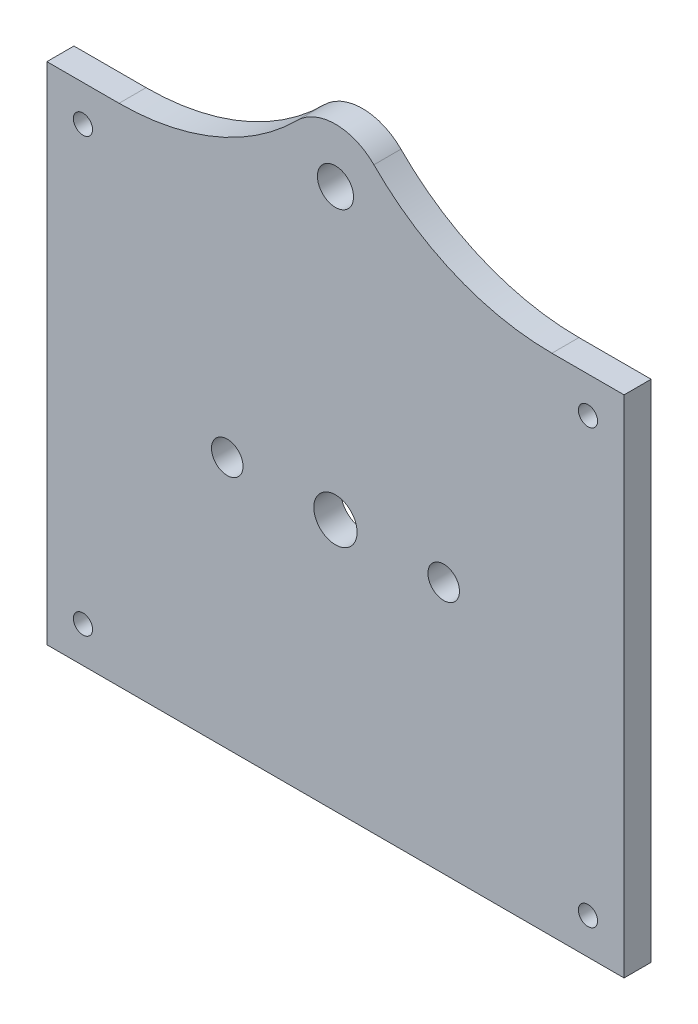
ISO-10303-21;
HEADER;
FILE_DESCRIPTION(('STEP AP214'),'2;1');
FILE_NAME('part.step','',(''),(''),'','','');
FILE_SCHEMA(('AUTOMOTIVE_DESIGN { 1 0 10303 214 1 1 1 1 }'));
ENDSEC;
DATA;
#1=APPLICATION_CONTEXT('core data for automotive mechanical design processes');
#2=APPLICATION_PROTOCOL_DEFINITION('international standard','automotive_design',2000,#1);
#3=PRODUCT_CONTEXT('',#1,'mechanical');
#4=PRODUCT('Part','Part','',(#3));
#5=PRODUCT_RELATED_PRODUCT_CATEGORY('part','',(#4));
#6=PRODUCT_DEFINITION_FORMATION('','',#4);
#7=PRODUCT_DEFINITION_CONTEXT('part definition',#1,'design');
#8=PRODUCT_DEFINITION('design','',#6,#7);
#9=PRODUCT_DEFINITION_SHAPE('','',#8);
#10=(LENGTH_UNIT() NAMED_UNIT(*) SI_UNIT(.MILLI.,.METRE.));
#11=(NAMED_UNIT(*) PLANE_ANGLE_UNIT() SI_UNIT($,.RADIAN.));
#12=(NAMED_UNIT(*) SI_UNIT($,.STERADIAN.) SOLID_ANGLE_UNIT());
#13=UNCERTAINTY_MEASURE_WITH_UNIT(LENGTH_MEASURE(1.E-05),#10,'distance_accuracy_value','');
#14=(GEOMETRIC_REPRESENTATION_CONTEXT(3) GLOBAL_UNCERTAINTY_ASSIGNED_CONTEXT((#13)) GLOBAL_UNIT_ASSIGNED_CONTEXT((#10,
#11,#12)) REPRESENTATION_CONTEXT('',''));
#15=CARTESIAN_POINT('',(0.,0.,0.));
#16=DIRECTION('',(0.,0.,1.));
#17=DIRECTION('',(1.,0.,0.));
#18=AXIS2_PLACEMENT_3D('',#15,#16,#17);
#19=CARTESIAN_POINT('',(-76.2,177.165,9.525));
#20=DIRECTION('',(0.,0.,1.));
#21=DIRECTION('',(1.,0.,0.));
#22=AXIS2_PLACEMENT_3D('',#19,#20,#21);
#23=PLANE('',#22);
#24=CARTESIAN_POINT('',(0.,0.,9.525));
#25=DIRECTION('',(0.,0.,1.));
#26=DIRECTION('',(1.,0.,0.));
#27=AXIS2_PLACEMENT_3D('',#24,#25,#26);
#28=CIRCLE('',#27,7.62);
#29=CARTESIAN_POINT('',(7.62,0.,9.525));
#30=VERTEX_POINT('',#29);
#31=EDGE_CURVE('E223',#30,#30,#28,.T.);
#32=ORIENTED_EDGE('',*,*,#31,.F.);
#33=EDGE_LOOP('',(#32));
#34=FACE_BOUND('',#33,.T.);
#35=CARTESIAN_POINT('',(0.,101.6,9.525));
#36=DIRECTION('',(0.,0.,1.));
#37=DIRECTION('',(1.,0.,0.));
#38=AXIS2_PLACEMENT_3D('',#35,#36,#37);
#39=CIRCLE('',#38,6.35);
#40=CARTESIAN_POINT('',(6.35,101.6,9.525));
#41=VERTEX_POINT('',#40);
#42=EDGE_CURVE('E219',#41,#41,#39,.T.);
#43=ORIENTED_EDGE('',*,*,#42,.F.);
#44=EDGE_LOOP('',(#43));
#45=FACE_BOUND('',#44,.T.);
#46=CARTESIAN_POINT('',(88.9,76.2,9.525));
#47=DIRECTION('',(0.,0.,1.));
#48=DIRECTION('',(1.,0.,0.));
#49=AXIS2_PLACEMENT_3D('',#46,#47,#48);
#50=CIRCLE('',#49,3.3782);
#51=CARTESIAN_POINT('',(92.2782,76.2,9.525));
#52=VERTEX_POINT('',#51);
#53=EDGE_CURVE('E213',#52,#52,#50,.T.);
#54=ORIENTED_EDGE('',*,*,#53,.F.);
#55=EDGE_LOOP('',(#54));
#56=FACE_BOUND('',#55,.T.);
#57=CARTESIAN_POINT('',(-88.9,-76.2,9.525));
#58=DIRECTION('',(0.,0.,1.));
#59=DIRECTION('',(1.,0.,0.));
#60=AXIS2_PLACEMENT_3D('',#57,#58,#59);
#61=CIRCLE('',#60,3.3782);
#62=CARTESIAN_POINT('',(-85.5218,-76.2,9.525));
#63=VERTEX_POINT('',#62);
#64=EDGE_CURVE('E207',#63,#63,#61,.T.);
#65=ORIENTED_EDGE('',*,*,#64,.F.);
#66=EDGE_LOOP('',(#65));
#67=FACE_BOUND('',#66,.T.);
#68=CARTESIAN_POINT('',(-88.9,76.2,9.525));
#69=DIRECTION('',(0.,0.,1.));
#70=DIRECTION('',(1.,0.,0.));
#71=AXIS2_PLACEMENT_3D('',#68,#69,#70);
#72=CIRCLE('',#71,3.3782);
#73=CARTESIAN_POINT('',(-85.5218,76.2,9.525));
#74=VERTEX_POINT('',#73);
#75=EDGE_CURVE('E201',#74,#74,#72,.T.);
#76=ORIENTED_EDGE('',*,*,#75,.F.);
#77=EDGE_LOOP('',(#76));
#78=FACE_BOUND('',#77,.T.);
#79=CARTESIAN_POINT('',(88.9,-76.2,9.525));
#80=DIRECTION('',(0.,0.,1.));
#81=DIRECTION('',(1.,0.,0.));
#82=AXIS2_PLACEMENT_3D('',#79,#80,#81);
#83=CIRCLE('',#82,3.3782);
#84=CARTESIAN_POINT('',(92.2782,-76.2,9.525));
#85=VERTEX_POINT('',#84);
#86=EDGE_CURVE('E195',#85,#85,#83,.T.);
#87=ORIENTED_EDGE('',*,*,#86,.F.);
#88=EDGE_LOOP('',(#87));
#89=FACE_BOUND('',#88,.T.);
#90=CARTESIAN_POINT('',(-38.1,0.,9.525));
#91=DIRECTION('',(0.,0.,1.));
#92=DIRECTION('',(1.,0.,0.));
#93=AXIS2_PLACEMENT_3D('',#90,#91,#92);
#94=CIRCLE('',#93,5.55625);
#95=CARTESIAN_POINT('',(-43.65625,0.,9.525));
#96=VERTEX_POINT('',#95);
#97=EDGE_CURVE('E136',#96,#96,#94,.T.);
#98=ORIENTED_EDGE('',*,*,#97,.F.);
#99=EDGE_LOOP('',(#98));
#100=FACE_BOUND('',#99,.T.);
#101=CARTESIAN_POINT('',(-76.2,177.165,9.525));
#102=DIRECTION('',(0.,0.,-1.));
#103=DIRECTION('',(1.,0.,0.));
#104=AXIS2_PLACEMENT_3D('',#101,#102,#103);
#105=CIRCLE('',#104,88.265);
#106=CARTESIAN_POINT('',(-13.5266272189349,115.013905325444,9.525));
#107=VERTEX_POINT('',#106);
#108=CARTESIAN_POINT('',(-76.2,88.9,9.525));
#109=VERTEX_POINT('',#108);
#110=EDGE_CURVE('E147',#107,#109,#105,.T.);
#111=ORIENTED_EDGE('',*,*,#110,.T.);
#112=DIRECTION('',(-1.,0.,0.));
#113=VECTOR('',#112,1.);
#114=CARTESIAN_POINT('',(-76.2,88.9,9.525));
#115=LINE('',#114,#113);
#116=CARTESIAN_POINT('',(-101.6,88.9,9.525));
#117=VERTEX_POINT('',#116);
#118=EDGE_CURVE('E95',#109,#117,#115,.T.);
#119=ORIENTED_EDGE('',*,*,#118,.T.);
#120=DIRECTION('',(0.,-1.,0.));
#121=VECTOR('',#120,1.);
#122=CARTESIAN_POINT('',(-101.6,-88.9,9.525));
#123=LINE('',#122,#121);
#124=CARTESIAN_POINT('',(-101.6,-88.9,9.525));
#125=VERTEX_POINT('',#124);
#126=EDGE_CURVE('E162',#117,#125,#123,.T.);
#127=ORIENTED_EDGE('',*,*,#126,.T.);
#128=DIRECTION('',(1.,0.,0.));
#129=VECTOR('',#128,1.);
#130=CARTESIAN_POINT('',(-101.6,-88.9,9.525));
#131=LINE('',#130,#129);
#132=CARTESIAN_POINT('',(101.6,-88.9,9.525));
#133=VERTEX_POINT('',#132);
#134=EDGE_CURVE('E175',#125,#133,#131,.T.);
#135=ORIENTED_EDGE('',*,*,#134,.T.);
#136=DIRECTION('',(0.,1.,0.));
#137=VECTOR('',#136,1.);
#138=CARTESIAN_POINT('',(101.6,-88.9,9.525));
#139=LINE('',#138,#137);
#140=CARTESIAN_POINT('',(101.6,88.9,9.525));
#141=VERTEX_POINT('',#140);
#142=EDGE_CURVE('E114',#133,#141,#139,.T.);
#143=ORIENTED_EDGE('',*,*,#142,.T.);
#144=DIRECTION('',(-1.,0.,0.));
#145=VECTOR('',#144,1.);
#146=CARTESIAN_POINT('',(101.6,88.9,9.525));
#147=LINE('',#146,#145);
#148=CARTESIAN_POINT('',(76.2,88.9,9.525));
#149=VERTEX_POINT('',#148);
#150=EDGE_CURVE('E108',#141,#149,#147,.T.);
#151=ORIENTED_EDGE('',*,*,#150,.T.);
#152=CARTESIAN_POINT('',(76.2,177.165,9.525));
#153=DIRECTION('',(0.,0.,-1.));
#154=DIRECTION('',(-1.,0.,0.));
#155=AXIS2_PLACEMENT_3D('',#152,#153,#154);
#156=CIRCLE('',#155,88.265);
#157=CARTESIAN_POINT('',(13.5266272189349,115.013905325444,9.525));
#158=VERTEX_POINT('',#157);
#159=EDGE_CURVE('E112',#149,#158,#156,.T.);
#160=ORIENTED_EDGE('',*,*,#159,.T.);
#161=CARTESIAN_POINT('',(0.,101.6,9.525));
#162=DIRECTION('',(0.,0.,1.));
#163=DIRECTION('',(1.,0.,0.));
#164=AXIS2_PLACEMENT_3D('',#161,#162,#163);
#165=CIRCLE('',#164,19.05);
#166=EDGE_CURVE('E52',#158,#107,#165,.T.);
#167=ORIENTED_EDGE('',*,*,#166,.T.);
#168=EDGE_LOOP('',(#111,#119,#127,#135,#143,#151,#160,#167));
#169=FACE_BOUND('',#168,.T.);
#170=CARTESIAN_POINT('',(38.1,0.,9.525));
#171=DIRECTION('',(0.,0.,1.));
#172=DIRECTION('',(-1.,0.,0.));
#173=AXIS2_PLACEMENT_3D('',#170,#171,#172);
#174=CIRCLE('',#173,5.55625);
#175=CARTESIAN_POINT('',(32.54375,0.,9.525));
#176=VERTEX_POINT('',#175);
#177=EDGE_CURVE('E184',#176,#176,#174,.T.);
#178=ORIENTED_EDGE('',*,*,#177,.F.);
#179=EDGE_LOOP('',(#178));
#180=FACE_BOUND('',#179,.T.);
#181=ADVANCED_FACE('F35',(#34,#45,#56,#67,#78,#89,#100,#169,#180),#23,.T.);
#182=CARTESIAN_POINT('',(-76.2,177.165,0.));
#183=DIRECTION('',(0.,0.,1.));
#184=DIRECTION('',(1.,0.,0.));
#185=AXIS2_PLACEMENT_3D('',#182,#183,#184);
#186=PLANE('',#185);
#187=CARTESIAN_POINT('',(0.,0.,0.));
#188=DIRECTION('',(0.,0.,1.));
#189=DIRECTION('',(1.,0.,0.));
#190=AXIS2_PLACEMENT_3D('',#187,#188,#189);
#191=CIRCLE('',#190,7.62);
#192=CARTESIAN_POINT('',(7.62,0.,0.));
#193=VERTEX_POINT('',#192);
#194=EDGE_CURVE('E222',#193,#193,#191,.T.);
#195=ORIENTED_EDGE('',*,*,#194,.T.);
#196=EDGE_LOOP('',(#195));
#197=FACE_BOUND('',#196,.T.);
#198=CARTESIAN_POINT('',(0.,101.6,0.));
#199=DIRECTION('',(0.,0.,1.));
#200=DIRECTION('',(1.,0.,0.));
#201=AXIS2_PLACEMENT_3D('',#198,#199,#200);
#202=CIRCLE('',#201,6.35);
#203=CARTESIAN_POINT('',(6.35,101.6,0.));
#204=VERTEX_POINT('',#203);
#205=EDGE_CURVE('E216',#204,#204,#202,.T.);
#206=ORIENTED_EDGE('',*,*,#205,.T.);
#207=EDGE_LOOP('',(#206));
#208=FACE_BOUND('',#207,.T.);
#209=CARTESIAN_POINT('',(88.9,76.2,0.));
#210=DIRECTION('',(0.,0.,1.));
#211=DIRECTION('',(1.,0.,0.));
#212=AXIS2_PLACEMENT_3D('',#209,#210,#211);
#213=CIRCLE('',#212,3.3782);
#214=CARTESIAN_POINT('',(92.2782,76.2,0.));
#215=VERTEX_POINT('',#214);
#216=EDGE_CURVE('E210',#215,#215,#213,.T.);
#217=ORIENTED_EDGE('',*,*,#216,.T.);
#218=EDGE_LOOP('',(#217));
#219=FACE_BOUND('',#218,.T.);
#220=CARTESIAN_POINT('',(-88.9,-76.2,0.));
#221=DIRECTION('',(0.,0.,1.));
#222=DIRECTION('',(1.,0.,0.));
#223=AXIS2_PLACEMENT_3D('',#220,#221,#222);
#224=CIRCLE('',#223,3.3782);
#225=CARTESIAN_POINT('',(-85.5218,-76.2,0.));
#226=VERTEX_POINT('',#225);
#227=EDGE_CURVE('E204',#226,#226,#224,.T.);
#228=ORIENTED_EDGE('',*,*,#227,.T.);
#229=EDGE_LOOP('',(#228));
#230=FACE_BOUND('',#229,.T.);
#231=CARTESIAN_POINT('',(-88.9,76.2,0.));
#232=DIRECTION('',(0.,0.,1.));
#233=DIRECTION('',(1.,0.,0.));
#234=AXIS2_PLACEMENT_3D('',#231,#232,#233);
#235=CIRCLE('',#234,3.3782);
#236=CARTESIAN_POINT('',(-85.5218,76.2,0.));
#237=VERTEX_POINT('',#236);
#238=EDGE_CURVE('E198',#237,#237,#235,.T.);
#239=ORIENTED_EDGE('',*,*,#238,.T.);
#240=EDGE_LOOP('',(#239));
#241=FACE_BOUND('',#240,.T.);
#242=CARTESIAN_POINT('',(88.9,-76.2,0.));
#243=DIRECTION('',(0.,0.,1.));
#244=DIRECTION('',(1.,0.,0.));
#245=AXIS2_PLACEMENT_3D('',#242,#243,#244);
#246=CIRCLE('',#245,3.3782);
#247=CARTESIAN_POINT('',(92.2782,-76.2,0.));
#248=VERTEX_POINT('',#247);
#249=EDGE_CURVE('E190',#248,#248,#246,.T.);
#250=ORIENTED_EDGE('',*,*,#249,.T.);
#251=EDGE_LOOP('',(#250));
#252=FACE_BOUND('',#251,.T.);
#253=CARTESIAN_POINT('',(-76.2,177.165,0.));
#254=DIRECTION('',(0.,0.,-1.));
#255=DIRECTION('',(1.,0.,0.));
#256=AXIS2_PLACEMENT_3D('',#253,#254,#255);
#257=CIRCLE('',#256,88.265);
#258=CARTESIAN_POINT('',(-13.5266272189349,115.013905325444,0.));
#259=VERTEX_POINT('',#258);
#260=CARTESIAN_POINT('',(-76.2,88.9,0.));
#261=VERTEX_POINT('',#260);
#262=EDGE_CURVE('E132',#259,#261,#257,.T.);
#263=ORIENTED_EDGE('',*,*,#262,.F.);
#264=CARTESIAN_POINT('',(0.,101.6,0.));
#265=DIRECTION('',(0.,0.,1.));
#266=DIRECTION('',(1.,0.,0.));
#267=AXIS2_PLACEMENT_3D('',#264,#265,#266);
#268=CIRCLE('',#267,19.05);
#269=CARTESIAN_POINT('',(13.5266272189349,115.013905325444,0.));
#270=VERTEX_POINT('',#269);
#271=EDGE_CURVE('E87',#270,#259,#268,.T.);
#272=ORIENTED_EDGE('',*,*,#271,.F.);
#273=CARTESIAN_POINT('',(76.2,177.165,0.));
#274=DIRECTION('',(0.,0.,-1.));
#275=DIRECTION('',(-1.,0.,0.));
#276=AXIS2_PLACEMENT_3D('',#273,#274,#275);
#277=CIRCLE('',#276,88.265);
#278=CARTESIAN_POINT('',(76.2,88.9,0.));
#279=VERTEX_POINT('',#278);
#280=EDGE_CURVE('E81',#279,#270,#277,.T.);
#281=ORIENTED_EDGE('',*,*,#280,.F.);
#282=DIRECTION('',(-1.,0.,0.));
#283=VECTOR('',#282,1.);
#284=CARTESIAN_POINT('',(101.6,88.9,0.));
#285=LINE('',#284,#283);
#286=CARTESIAN_POINT('',(101.6,88.9,0.));
#287=VERTEX_POINT('',#286);
#288=EDGE_CURVE('E122',#287,#279,#285,.T.);
#289=ORIENTED_EDGE('',*,*,#288,.F.);
#290=DIRECTION('',(0.,1.,0.));
#291=VECTOR('',#290,1.);
#292=CARTESIAN_POINT('',(101.6,-88.9,0.));
#293=LINE('',#292,#291);
#294=CARTESIAN_POINT('',(101.6,-88.9,0.));
#295=VERTEX_POINT('',#294);
#296=EDGE_CURVE('E142',#295,#287,#293,.T.);
#297=ORIENTED_EDGE('',*,*,#296,.F.);
#298=DIRECTION('',(1.,0.,0.));
#299=VECTOR('',#298,1.);
#300=CARTESIAN_POINT('',(-101.6,-88.9,0.));
#301=LINE('',#300,#299);
#302=CARTESIAN_POINT('',(-101.6,-88.9,0.));
#303=VERTEX_POINT('',#302);
#304=EDGE_CURVE('E140',#303,#295,#301,.T.);
#305=ORIENTED_EDGE('',*,*,#304,.F.);
#306=DIRECTION('',(0.,-1.,0.));
#307=VECTOR('',#306,1.);
#308=CARTESIAN_POINT('',(-101.6,-88.9,0.));
#309=LINE('',#308,#307);
#310=CARTESIAN_POINT('',(-101.6,88.9,0.));
#311=VERTEX_POINT('',#310);
#312=EDGE_CURVE('E138',#311,#303,#309,.T.);
#313=ORIENTED_EDGE('',*,*,#312,.F.);
#314=DIRECTION('',(-1.,0.,0.));
#315=VECTOR('',#314,1.);
#316=CARTESIAN_POINT('',(-76.2,88.9,0.));
#317=LINE('',#316,#315);
#318=EDGE_CURVE('E135',#261,#311,#317,.T.);
#319=ORIENTED_EDGE('',*,*,#318,.F.);
#320=EDGE_LOOP('',(#263,#272,#281,#289,#297,#305,#313,#319));
#321=FACE_BOUND('',#320,.T.);
#322=CARTESIAN_POINT('',(-38.1,0.,0.));
#323=DIRECTION('',(0.,0.,1.));
#324=DIRECTION('',(1.,0.,0.));
#325=AXIS2_PLACEMENT_3D('',#322,#323,#324);
#326=CIRCLE('',#325,5.55625);
#327=CARTESIAN_POINT('',(-43.65625,0.,0.));
#328=VERTEX_POINT('',#327);
#329=EDGE_CURVE('E181',#328,#328,#326,.T.);
#330=ORIENTED_EDGE('',*,*,#329,.T.);
#331=EDGE_LOOP('',(#330));
#332=FACE_BOUND('',#331,.T.);
#333=CARTESIAN_POINT('',(38.1,0.,0.));
#334=DIRECTION('',(0.,0.,1.));
#335=DIRECTION('',(-1.,0.,0.));
#336=AXIS2_PLACEMENT_3D('',#333,#334,#335);
#337=CIRCLE('',#336,5.55625);
#338=CARTESIAN_POINT('',(32.54375,0.,0.));
#339=VERTEX_POINT('',#338);
#340=EDGE_CURVE('E187',#339,#339,#337,.T.);
#341=ORIENTED_EDGE('',*,*,#340,.T.);
#342=EDGE_LOOP('',(#341));
#343=FACE_BOUND('',#342,.T.);
#344=ADVANCED_FACE('F166',(#197,#208,#219,#230,#241,#252,#321,#332,#343),#186,.F.);
#345=CARTESIAN_POINT('',(-76.2,177.165,9.525));
#346=DIRECTION('',(0.,0.,-1.));
#347=DIRECTION('',(-1.,0.,0.));
#348=AXIS2_PLACEMENT_3D('',#345,#346,#347);
#349=CYLINDRICAL_SURFACE('',#348,88.265);
#350=ORIENTED_EDGE('',*,*,#262,.T.);
#351=DIRECTION('',(0.,0.,-1.));
#352=VECTOR('',#351,1.);
#353=CARTESIAN_POINT('',(-76.2,88.9,9.525));
#354=LINE('',#353,#352);
#355=EDGE_CURVE('E11',#109,#261,#354,.T.);
#356=ORIENTED_EDGE('',*,*,#355,.F.);
#357=ORIENTED_EDGE('',*,*,#110,.F.);
#358=DIRECTION('',(0.,0.,-1.));
#359=VECTOR('',#358,1.);
#360=CARTESIAN_POINT('',(-13.5266272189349,115.013905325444,9.525));
#361=LINE('',#360,#359);
#362=EDGE_CURVE('E128',#107,#259,#361,.T.);
#363=ORIENTED_EDGE('',*,*,#362,.T.);
#364=EDGE_LOOP('',(#350,#356,#357,#363));
#365=FACE_BOUND('',#364,.T.);
#366=ADVANCED_FACE('F37',(#365),#349,.F.);
#367=CARTESIAN_POINT('',(-76.2,88.9,9.525));
#368=DIRECTION('',(0.,-1.,0.));
#369=DIRECTION('',(0.,0.,-1.));
#370=AXIS2_PLACEMENT_3D('',#367,#368,#369);
#371=PLANE('',#370);
#372=ORIENTED_EDGE('',*,*,#318,.T.);
#373=DIRECTION('',(0.,0.,-1.));
#374=VECTOR('',#373,1.);
#375=CARTESIAN_POINT('',(-101.6,88.9,9.525));
#376=LINE('',#375,#374);
#377=EDGE_CURVE('E44',#117,#311,#376,.T.);
#378=ORIENTED_EDGE('',*,*,#377,.F.);
#379=ORIENTED_EDGE('',*,*,#118,.F.);
#380=ORIENTED_EDGE('',*,*,#355,.T.);
#381=EDGE_LOOP('',(#372,#378,#379,#380));
#382=FACE_BOUND('',#381,.T.);
#383=ADVANCED_FACE('F288',(#382),#371,.F.);
#384=CARTESIAN_POINT('',(-101.6,-88.9,9.525));
#385=DIRECTION('',(1.,0.,0.));
#386=DIRECTION('',(0.,0.,-1.));
#387=AXIS2_PLACEMENT_3D('',#384,#385,#386);
#388=PLANE('',#387);
#389=ORIENTED_EDGE('',*,*,#312,.T.);
#390=DIRECTION('',(0.,0.,-1.));
#391=VECTOR('',#390,1.);
#392=CARTESIAN_POINT('',(-101.6,-88.9,9.525));
#393=LINE('',#392,#391);
#394=EDGE_CURVE('E154',#125,#303,#393,.T.);
#395=ORIENTED_EDGE('',*,*,#394,.F.);
#396=ORIENTED_EDGE('',*,*,#126,.F.);
#397=ORIENTED_EDGE('',*,*,#377,.T.);
#398=EDGE_LOOP('',(#389,#395,#396,#397));
#399=FACE_BOUND('',#398,.T.);
#400=ADVANCED_FACE('F160',(#399),#388,.F.);
#401=CARTESIAN_POINT('',(-101.6,-88.9,9.525));
#402=DIRECTION('',(0.,1.,0.));
#403=DIRECTION('',(-1.,0.,0.));
#404=AXIS2_PLACEMENT_3D('',#401,#402,#403);
#405=PLANE('',#404);
#406=ORIENTED_EDGE('',*,*,#304,.T.);
#407=DIRECTION('',(0.,0.,-1.));
#408=VECTOR('',#407,1.);
#409=CARTESIAN_POINT('',(101.6,-88.9,9.525));
#410=LINE('',#409,#408);
#411=EDGE_CURVE('E151',#133,#295,#410,.T.);
#412=ORIENTED_EDGE('',*,*,#411,.F.);
#413=ORIENTED_EDGE('',*,*,#134,.F.);
#414=ORIENTED_EDGE('',*,*,#394,.T.);
#415=EDGE_LOOP('',(#406,#412,#413,#414));
#416=FACE_BOUND('',#415,.T.);
#417=ADVANCED_FACE('F171',(#416),#405,.F.);
#418=CARTESIAN_POINT('',(101.6,-88.9,9.525));
#419=DIRECTION('',(-1.,0.,0.));
#420=DIRECTION('',(0.,0.,1.));
#421=AXIS2_PLACEMENT_3D('',#418,#419,#420);
#422=PLANE('',#421);
#423=ORIENTED_EDGE('',*,*,#296,.T.);
#424=DIRECTION('',(0.,0.,-1.));
#425=VECTOR('',#424,1.);
#426=CARTESIAN_POINT('',(101.6,88.9,9.525));
#427=LINE('',#426,#425);
#428=EDGE_CURVE('E123',#141,#287,#427,.T.);
#429=ORIENTED_EDGE('',*,*,#428,.F.);
#430=ORIENTED_EDGE('',*,*,#142,.F.);
#431=ORIENTED_EDGE('',*,*,#411,.T.);
#432=EDGE_LOOP('',(#423,#429,#430,#431));
#433=FACE_BOUND('',#432,.T.);
#434=ADVANCED_FACE('F174',(#433),#422,.F.);
#435=CARTESIAN_POINT('',(101.6,88.9,9.525));
#436=DIRECTION('',(0.,-1.,0.));
#437=DIRECTION('',(1.,0.,0.));
#438=AXIS2_PLACEMENT_3D('',#435,#436,#437);
#439=PLANE('',#438);
#440=ORIENTED_EDGE('',*,*,#288,.T.);
#441=DIRECTION('',(0.,0.,-1.));
#442=VECTOR('',#441,1.);
#443=CARTESIAN_POINT('',(76.2,88.9,9.525));
#444=LINE('',#443,#442);
#445=EDGE_CURVE('E119',#149,#279,#444,.T.);
#446=ORIENTED_EDGE('',*,*,#445,.F.);
#447=ORIENTED_EDGE('',*,*,#150,.F.);
#448=ORIENTED_EDGE('',*,*,#428,.T.);
#449=EDGE_LOOP('',(#440,#446,#447,#448));
#450=FACE_BOUND('',#449,.T.);
#451=ADVANCED_FACE('F120',(#450),#439,.F.);
#452=CARTESIAN_POINT('',(76.2,177.165,9.525));
#453=DIRECTION('',(0.,0.,-1.));
#454=DIRECTION('',(-1.,0.,0.));
#455=AXIS2_PLACEMENT_3D('',#452,#453,#454);
#456=CYLINDRICAL_SURFACE('',#455,88.265);
#457=ORIENTED_EDGE('',*,*,#280,.T.);
#458=DIRECTION('',(0.,0.,-1.));
#459=VECTOR('',#458,1.);
#460=CARTESIAN_POINT('',(13.5266272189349,115.013905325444,9.525));
#461=LINE('',#460,#459);
#462=EDGE_CURVE('E124',#158,#270,#461,.T.);
#463=ORIENTED_EDGE('',*,*,#462,.F.);
#464=ORIENTED_EDGE('',*,*,#159,.F.);
#465=ORIENTED_EDGE('',*,*,#445,.T.);
#466=EDGE_LOOP('',(#457,#463,#464,#465));
#467=FACE_BOUND('',#466,.T.);
#468=ADVANCED_FACE('F126',(#467),#456,.F.);
#469=CARTESIAN_POINT('',(0.,101.6,9.525));
#470=DIRECTION('',(0.,0.,-1.));
#471=DIRECTION('',(-1.,0.,0.));
#472=AXIS2_PLACEMENT_3D('',#469,#470,#471);
#473=CYLINDRICAL_SURFACE('',#472,19.05);
#474=ORIENTED_EDGE('',*,*,#271,.T.);
#475=ORIENTED_EDGE('',*,*,#362,.F.);
#476=ORIENTED_EDGE('',*,*,#166,.F.);
#477=ORIENTED_EDGE('',*,*,#462,.T.);
#478=EDGE_LOOP('',(#474,#475,#476,#477));
#479=FACE_BOUND('',#478,.T.);
#480=ADVANCED_FACE('F257',(#479),#473,.T.);
#481=CARTESIAN_POINT('',(-38.1,0.,9.525));
#482=DIRECTION('',(0.,0.,-1.));
#483=DIRECTION('',(-1.,0.,0.));
#484=AXIS2_PLACEMENT_3D('',#481,#482,#483);
#485=CYLINDRICAL_SURFACE('',#484,5.55625);
#486=CARTESIAN_POINT('',(-43.65625,0.,9.525));
#487=CARTESIAN_POINT('',(-43.65625,0.,9.42578125));
#488=CARTESIAN_POINT('',(-43.65625,0.,9.3265625));
#489=CARTESIAN_POINT('',(-43.65625,0.,9.128125));
#490=CARTESIAN_POINT('',(-43.65625,0.,9.02890625));
#491=CARTESIAN_POINT('',(-43.65625,0.,8.83046875));
#492=CARTESIAN_POINT('',(-43.65625,0.,8.73125));
#493=CARTESIAN_POINT('',(-43.65625,0.,8.5328125));
#494=CARTESIAN_POINT('',(-43.65625,0.,8.43359375));
#495=CARTESIAN_POINT('',(-43.65625,0.,8.23515625));
#496=CARTESIAN_POINT('',(-43.65625,0.,8.1359375));
#497=CARTESIAN_POINT('',(-43.65625,0.,7.9375));
#498=CARTESIAN_POINT('',(-43.65625,0.,7.83828125));
#499=CARTESIAN_POINT('',(-43.65625,0.,7.63984375));
#500=CARTESIAN_POINT('',(-43.65625,0.,7.540625));
#501=CARTESIAN_POINT('',(-43.65625,0.,7.3421875));
#502=CARTESIAN_POINT('',(-43.65625,0.,7.24296875));
#503=CARTESIAN_POINT('',(-43.65625,0.,7.04453125));
#504=CARTESIAN_POINT('',(-43.65625,0.,6.9453125));
#505=CARTESIAN_POINT('',(-43.65625,0.,6.746875));
#506=CARTESIAN_POINT('',(-43.65625,0.,6.64765625));
#507=CARTESIAN_POINT('',(-43.65625,0.,6.44921875));
#508=CARTESIAN_POINT('',(-43.65625,0.,6.35));
#509=CARTESIAN_POINT('',(-43.65625,0.,6.1515625));
#510=CARTESIAN_POINT('',(-43.65625,0.,6.05234375));
#511=CARTESIAN_POINT('',(-43.65625,0.,5.85390625));
#512=CARTESIAN_POINT('',(-43.65625,0.,5.7546875));
#513=CARTESIAN_POINT('',(-43.65625,0.,5.55625));
#514=CARTESIAN_POINT('',(-43.65625,0.,5.45703125));
#515=CARTESIAN_POINT('',(-43.65625,0.,5.25859375));
#516=CARTESIAN_POINT('',(-43.65625,0.,5.159375));
#517=CARTESIAN_POINT('',(-43.65625,0.,4.9609375));
#518=CARTESIAN_POINT('',(-43.65625,0.,4.86171875));
#519=CARTESIAN_POINT('',(-43.65625,0.,4.66328125));
#520=CARTESIAN_POINT('',(-43.65625,0.,4.5640625));
#521=CARTESIAN_POINT('',(-43.65625,0.,4.365625));
#522=CARTESIAN_POINT('',(-43.65625,0.,4.26640625));
#523=CARTESIAN_POINT('',(-43.65625,0.,4.06796875));
#524=CARTESIAN_POINT('',(-43.65625,0.,3.96875));
#525=CARTESIAN_POINT('',(-43.65625,0.,3.7703125));
#526=CARTESIAN_POINT('',(-43.65625,0.,3.67109375));
#527=CARTESIAN_POINT('',(-43.65625,0.,3.47265625));
#528=CARTESIAN_POINT('',(-43.65625,0.,3.3734375));
#529=CARTESIAN_POINT('',(-43.65625,0.,3.175));
#530=CARTESIAN_POINT('',(-43.65625,0.,3.07578125));
#531=CARTESIAN_POINT('',(-43.65625,0.,2.87734375));
#532=CARTESIAN_POINT('',(-43.65625,0.,2.778125));
#533=CARTESIAN_POINT('',(-43.65625,0.,2.5796875));
#534=CARTESIAN_POINT('',(-43.65625,0.,2.48046875));
#535=CARTESIAN_POINT('',(-43.65625,0.,2.28203125));
#536=CARTESIAN_POINT('',(-43.65625,0.,2.1828125));
#537=CARTESIAN_POINT('',(-43.65625,0.,1.984375));
#538=CARTESIAN_POINT('',(-43.65625,0.,1.88515625));
#539=CARTESIAN_POINT('',(-43.65625,0.,1.68671875));
#540=CARTESIAN_POINT('',(-43.65625,0.,1.5875));
#541=CARTESIAN_POINT('',(-43.65625,0.,1.3890625));
#542=CARTESIAN_POINT('',(-43.65625,0.,1.28984375));
#543=CARTESIAN_POINT('',(-43.65625,0.,1.09140625));
#544=CARTESIAN_POINT('',(-43.65625,0.,0.992187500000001));
#545=CARTESIAN_POINT('',(-43.65625,0.,0.793750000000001));
#546=CARTESIAN_POINT('',(-43.65625,0.,0.69453125));
#547=CARTESIAN_POINT('',(-43.65625,0.,0.49609375));
#548=CARTESIAN_POINT('',(-43.65625,0.,0.396875));
#549=CARTESIAN_POINT('',(-43.65625,0.,0.1984375));
#550=CARTESIAN_POINT('',(-43.65625,0.,0.0992187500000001));
#551=CARTESIAN_POINT('',(-43.65625,0.,0.));
#552=B_SPLINE_CURVE_WITH_KNOTS('',3,(#486,#487,#488,#489,#490,#491,#492,#493,#494,#495,#496,
#497,#498,#499,#500,#501,#502,#503,#504,#505,#506,#507,#508,#509,#510,#511,#512,#513,#514,#515,
#516,#517,#518,#519,#520,#521,#522,#523,#524,#525,#526,#527,#528,#529,#530,#531,#532,#533,#534,
#535,#536,#537,#538,#539,#540,#541,#542,#543,#544,#545,#546,#547,#548,#549,#550,#551),
.UNSPECIFIED.,.F.,.F.,(4,2,2,2,2,2,2,2,2,2,2,2,2,2,2,2,2,2,2,2,2,2,2,2,2,2,2,2,2,2,2,2,4),(0.,
0.29765625,0.5953125,0.892968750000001,1.190625,1.48828125,1.7859375,2.08359375,2.38125,
2.67890625,2.9765625,3.27421875,3.571875,3.86953125,4.1671875,4.46484375,4.7625,5.06015625,
5.3578125,5.65546875,5.953125,6.25078125,6.5484375,6.84609375,7.14375,7.44140625,7.7390625,
8.03671875,8.334375,8.63203125,8.9296875,9.22734375,9.525),.UNSPECIFIED.);
#553=EDGE_CURVE('BSEAM253',#96,#328,#552,.T.);
#554=ORIENTED_EDGE('',*,*,#97,.T.);
#555=ORIENTED_EDGE('',*,*,#329,.F.);
#556=ORIENTED_EDGE('',*,*,#553,.T.);
#557=ORIENTED_EDGE('',*,*,#553,.F.);
#558=EDGE_LOOP('',(#554,#556,#555,#557));
#559=FACE_BOUND('',#558,.T.);
#560=ADVANCED_FACE('F253',(#559),#485,.F.);
#561=CARTESIAN_POINT('',(38.1,0.,9.525));
#562=DIRECTION('',(0.,0.,-1.));
#563=DIRECTION('',(-1.,0.,0.));
#564=AXIS2_PLACEMENT_3D('',#561,#562,#563);
#565=CYLINDRICAL_SURFACE('',#564,5.55625);
#566=CARTESIAN_POINT('',(32.54375,0.,9.525));
#567=CARTESIAN_POINT('',(32.54375,0.,9.42578125));
#568=CARTESIAN_POINT('',(32.54375,0.,9.3265625));
#569=CARTESIAN_POINT('',(32.54375,0.,9.128125));
#570=CARTESIAN_POINT('',(32.54375,0.,9.02890625));
#571=CARTESIAN_POINT('',(32.54375,0.,8.83046875));
#572=CARTESIAN_POINT('',(32.54375,0.,8.73125));
#573=CARTESIAN_POINT('',(32.54375,0.,8.5328125));
#574=CARTESIAN_POINT('',(32.54375,0.,8.43359375));
#575=CARTESIAN_POINT('',(32.54375,0.,8.23515625));
#576=CARTESIAN_POINT('',(32.54375,0.,8.1359375));
#577=CARTESIAN_POINT('',(32.54375,0.,7.9375));
#578=CARTESIAN_POINT('',(32.54375,0.,7.83828125));
#579=CARTESIAN_POINT('',(32.54375,0.,7.63984375));
#580=CARTESIAN_POINT('',(32.54375,0.,7.540625));
#581=CARTESIAN_POINT('',(32.54375,0.,7.3421875));
#582=CARTESIAN_POINT('',(32.54375,0.,7.24296875));
#583=CARTESIAN_POINT('',(32.54375,0.,7.04453125));
#584=CARTESIAN_POINT('',(32.54375,0.,6.9453125));
#585=CARTESIAN_POINT('',(32.54375,0.,6.746875));
#586=CARTESIAN_POINT('',(32.54375,0.,6.64765625));
#587=CARTESIAN_POINT('',(32.54375,0.,6.44921875));
#588=CARTESIAN_POINT('',(32.54375,0.,6.35));
#589=CARTESIAN_POINT('',(32.54375,0.,6.1515625));
#590=CARTESIAN_POINT('',(32.54375,0.,6.05234375));
#591=CARTESIAN_POINT('',(32.54375,0.,5.85390625));
#592=CARTESIAN_POINT('',(32.54375,0.,5.7546875));
#593=CARTESIAN_POINT('',(32.54375,0.,5.55625));
#594=CARTESIAN_POINT('',(32.54375,0.,5.45703125));
#595=CARTESIAN_POINT('',(32.54375,0.,5.25859375));
#596=CARTESIAN_POINT('',(32.54375,0.,5.159375));
#597=CARTESIAN_POINT('',(32.54375,0.,4.9609375));
#598=CARTESIAN_POINT('',(32.54375,0.,4.86171875));
#599=CARTESIAN_POINT('',(32.54375,0.,4.66328125));
#600=CARTESIAN_POINT('',(32.54375,0.,4.5640625));
#601=CARTESIAN_POINT('',(32.54375,0.,4.365625));
#602=CARTESIAN_POINT('',(32.54375,0.,4.26640625));
#603=CARTESIAN_POINT('',(32.54375,0.,4.06796875));
#604=CARTESIAN_POINT('',(32.54375,0.,3.96875));
#605=CARTESIAN_POINT('',(32.54375,0.,3.7703125));
#606=CARTESIAN_POINT('',(32.54375,0.,3.67109375));
#607=CARTESIAN_POINT('',(32.54375,0.,3.47265625));
#608=CARTESIAN_POINT('',(32.54375,0.,3.3734375));
#609=CARTESIAN_POINT('',(32.54375,0.,3.175));
#610=CARTESIAN_POINT('',(32.54375,0.,3.07578125));
#611=CARTESIAN_POINT('',(32.54375,0.,2.87734375));
#612=CARTESIAN_POINT('',(32.54375,0.,2.778125));
#613=CARTESIAN_POINT('',(32.54375,0.,2.5796875));
#614=CARTESIAN_POINT('',(32.54375,0.,2.48046875));
#615=CARTESIAN_POINT('',(32.54375,0.,2.28203125));
#616=CARTESIAN_POINT('',(32.54375,0.,2.1828125));
#617=CARTESIAN_POINT('',(32.54375,0.,1.984375));
#618=CARTESIAN_POINT('',(32.54375,0.,1.88515625));
#619=CARTESIAN_POINT('',(32.54375,0.,1.68671875));
#620=CARTESIAN_POINT('',(32.54375,0.,1.5875));
#621=CARTESIAN_POINT('',(32.54375,0.,1.3890625));
#622=CARTESIAN_POINT('',(32.54375,0.,1.28984375));
#623=CARTESIAN_POINT('',(32.54375,0.,1.09140625));
#624=CARTESIAN_POINT('',(32.54375,0.,0.992187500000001));
#625=CARTESIAN_POINT('',(32.54375,0.,0.793750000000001));
#626=CARTESIAN_POINT('',(32.54375,0.,0.69453125));
#627=CARTESIAN_POINT('',(32.54375,0.,0.49609375));
#628=CARTESIAN_POINT('',(32.54375,0.,0.396875));
#629=CARTESIAN_POINT('',(32.54375,0.,0.1984375));
#630=CARTESIAN_POINT('',(32.54375,0.,0.0992187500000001));
#631=CARTESIAN_POINT('',(32.54375,0.,0.));
#632=B_SPLINE_CURVE_WITH_KNOTS('',3,(#566,#567,#568,#569,#570,#571,#572,#573,#574,#575,#576,
#577,#578,#579,#580,#581,#582,#583,#584,#585,#586,#587,#588,#589,#590,#591,#592,#593,#594,#595,
#596,#597,#598,#599,#600,#601,#602,#603,#604,#605,#606,#607,#608,#609,#610,#611,#612,#613,#614,
#615,#616,#617,#618,#619,#620,#621,#622,#623,#624,#625,#626,#627,#628,#629,#630,#631),
.UNSPECIFIED.,.F.,.F.,(4,2,2,2,2,2,2,2,2,2,2,2,2,2,2,2,2,2,2,2,2,2,2,2,2,2,2,2,2,2,2,2,4),(0.,
0.29765625,0.5953125,0.892968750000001,1.190625,1.48828125,1.7859375,2.08359375,2.38125,
2.67890625,2.9765625,3.27421875,3.571875,3.86953125,4.1671875,4.46484375,4.7625,5.06015625,
5.3578125,5.65546875,5.953125,6.25078125,6.5484375,6.84609375,7.14375,7.44140625,7.7390625,
8.03671875,8.334375,8.63203125,8.9296875,9.22734375,9.525),.UNSPECIFIED.);
#633=EDGE_CURVE('BSEAM256',#176,#339,#632,.T.);
#634=ORIENTED_EDGE('',*,*,#177,.T.);
#635=ORIENTED_EDGE('',*,*,#340,.F.);
#636=ORIENTED_EDGE('',*,*,#633,.T.);
#637=ORIENTED_EDGE('',*,*,#633,.F.);
#638=EDGE_LOOP('',(#634,#636,#635,#637));
#639=FACE_BOUND('',#638,.T.);
#640=ADVANCED_FACE('F256',(#639),#565,.F.);
#641=CARTESIAN_POINT('',(88.9,-76.2,9.525));
#642=DIRECTION('',(0.,0.,1.));
#643=DIRECTION('',(1.,0.,0.));
#644=AXIS2_PLACEMENT_3D('',#641,#642,#643);
#645=CYLINDRICAL_SURFACE('',#644,3.3782);
#646=ORIENTED_EDGE('',*,*,#249,.F.);
#647=EDGE_LOOP('',(#646));
#648=FACE_BOUND('',#647,.T.);
#649=ORIENTED_EDGE('',*,*,#86,.T.);
#650=EDGE_LOOP('',(#649));
#651=FACE_BOUND('',#650,.T.);
#652=ADVANCED_FACE('F266',(#648,#651),#645,.F.);
#653=CARTESIAN_POINT('',(-88.9,76.2,9.525));
#654=DIRECTION('',(0.,0.,1.));
#655=DIRECTION('',(1.,0.,0.));
#656=AXIS2_PLACEMENT_3D('',#653,#654,#655);
#657=CYLINDRICAL_SURFACE('',#656,3.3782);
#658=ORIENTED_EDGE('',*,*,#238,.F.);
#659=EDGE_LOOP('',(#658));
#660=FACE_BOUND('',#659,.T.);
#661=ORIENTED_EDGE('',*,*,#75,.T.);
#662=EDGE_LOOP('',(#661));
#663=FACE_BOUND('',#662,.T.);
#664=ADVANCED_FACE('F272',(#660,#663),#657,.F.);
#665=CARTESIAN_POINT('',(-88.9,-76.2,9.525));
#666=DIRECTION('',(0.,0.,1.));
#667=DIRECTION('',(1.,0.,0.));
#668=AXIS2_PLACEMENT_3D('',#665,#666,#667);
#669=CYLINDRICAL_SURFACE('',#668,3.3782);
#670=ORIENTED_EDGE('',*,*,#227,.F.);
#671=EDGE_LOOP('',(#670));
#672=FACE_BOUND('',#671,.T.);
#673=ORIENTED_EDGE('',*,*,#64,.T.);
#674=EDGE_LOOP('',(#673));
#675=FACE_BOUND('',#674,.T.);
#676=ADVANCED_FACE('F327',(#672,#675),#669,.F.);
#677=CARTESIAN_POINT('',(88.9,76.2,9.525));
#678=DIRECTION('',(0.,0.,1.));
#679=DIRECTION('',(1.,0.,0.));
#680=AXIS2_PLACEMENT_3D('',#677,#678,#679);
#681=CYLINDRICAL_SURFACE('',#680,3.3782);
#682=ORIENTED_EDGE('',*,*,#216,.F.);
#683=EDGE_LOOP('',(#682));
#684=FACE_BOUND('',#683,.T.);
#685=ORIENTED_EDGE('',*,*,#53,.T.);
#686=EDGE_LOOP('',(#685));
#687=FACE_BOUND('',#686,.T.);
#688=ADVANCED_FACE('F316',(#684,#687),#681,.F.);
#689=CARTESIAN_POINT('',(0.,101.6,9.525));
#690=DIRECTION('',(0.,0.,1.));
#691=DIRECTION('',(1.,0.,0.));
#692=AXIS2_PLACEMENT_3D('',#689,#690,#691);
#693=CYLINDRICAL_SURFACE('',#692,6.35);
#694=ORIENTED_EDGE('',*,*,#205,.F.);
#695=EDGE_LOOP('',(#694));
#696=FACE_BOUND('',#695,.T.);
#697=ORIENTED_EDGE('',*,*,#42,.T.);
#698=EDGE_LOOP('',(#697));
#699=FACE_BOUND('',#698,.T.);
#700=ADVANCED_FACE('F234',(#696,#699),#693,.F.);
#701=CARTESIAN_POINT('',(0.,0.,0.));
#702=DIRECTION('',(0.,0.,1.));
#703=DIRECTION('',(1.,0.,0.));
#704=AXIS2_PLACEMENT_3D('',#701,#702,#703);
#705=CYLINDRICAL_SURFACE('',#704,7.62);
#706=CARTESIAN_POINT('',(7.62,0.,0.));
#707=CARTESIAN_POINT('',(7.62,0.,0.0992187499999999));
#708=CARTESIAN_POINT('',(7.62,0.,0.1984375));
#709=CARTESIAN_POINT('',(7.62,0.,0.396875));
#710=CARTESIAN_POINT('',(7.62,0.,0.49609375));
#711=CARTESIAN_POINT('',(7.62,0.,0.69453125));
#712=CARTESIAN_POINT('',(7.62,0.,0.79375));
#713=CARTESIAN_POINT('',(7.62,0.,0.9921875));
#714=CARTESIAN_POINT('',(7.62,0.,1.09140625));
#715=CARTESIAN_POINT('',(7.62,0.,1.28984375));
#716=CARTESIAN_POINT('',(7.62,0.,1.3890625));
#717=CARTESIAN_POINT('',(7.62,0.,1.5875));
#718=CARTESIAN_POINT('',(7.62,0.,1.68671875));
#719=CARTESIAN_POINT('',(7.62,0.,1.88515625));
#720=CARTESIAN_POINT('',(7.62,0.,1.984375));
#721=CARTESIAN_POINT('',(7.62,0.,2.1828125));
#722=CARTESIAN_POINT('',(7.62,0.,2.28203125));
#723=CARTESIAN_POINT('',(7.62,0.,2.48046875));
#724=CARTESIAN_POINT('',(7.62,0.,2.5796875));
#725=CARTESIAN_POINT('',(7.62,0.,2.778125));
#726=CARTESIAN_POINT('',(7.62,0.,2.87734375));
#727=CARTESIAN_POINT('',(7.62,0.,3.07578125));
#728=CARTESIAN_POINT('',(7.62,0.,3.175));
#729=CARTESIAN_POINT('',(7.62,0.,3.3734375));
#730=CARTESIAN_POINT('',(7.62,0.,3.47265625));
#731=CARTESIAN_POINT('',(7.62,0.,3.67109375));
#732=CARTESIAN_POINT('',(7.62,0.,3.7703125));
#733=CARTESIAN_POINT('',(7.62,0.,3.96875));
#734=CARTESIAN_POINT('',(7.62,0.,4.06796875));
#735=CARTESIAN_POINT('',(7.62,0.,4.26640625));
#736=CARTESIAN_POINT('',(7.62,0.,4.365625));
#737=CARTESIAN_POINT('',(7.62,0.,4.5640625));
#738=CARTESIAN_POINT('',(7.62,0.,4.66328125));
#739=CARTESIAN_POINT('',(7.62,0.,4.86171875));
#740=CARTESIAN_POINT('',(7.62,0.,4.9609375));
#741=CARTESIAN_POINT('',(7.62,0.,5.159375));
#742=CARTESIAN_POINT('',(7.62,0.,5.25859375));
#743=CARTESIAN_POINT('',(7.62,0.,5.45703125));
#744=CARTESIAN_POINT('',(7.62,0.,5.55625));
#745=CARTESIAN_POINT('',(7.62,0.,5.7546875));
#746=CARTESIAN_POINT('',(7.62,0.,5.85390625));
#747=CARTESIAN_POINT('',(7.62,0.,6.05234375));
#748=CARTESIAN_POINT('',(7.62,0.,6.1515625));
#749=CARTESIAN_POINT('',(7.62,0.,6.35));
#750=CARTESIAN_POINT('',(7.62,0.,6.44921875));
#751=CARTESIAN_POINT('',(7.62,0.,6.64765625));
#752=CARTESIAN_POINT('',(7.62,0.,6.746875));
#753=CARTESIAN_POINT('',(7.62,0.,6.9453125));
#754=CARTESIAN_POINT('',(7.62,0.,7.04453125));
#755=CARTESIAN_POINT('',(7.62,0.,7.24296875));
#756=CARTESIAN_POINT('',(7.62,0.,7.3421875));
#757=CARTESIAN_POINT('',(7.62,0.,7.540625));
#758=CARTESIAN_POINT('',(7.62,0.,7.63984375));
#759=CARTESIAN_POINT('',(7.62,0.,7.83828125));
#760=CARTESIAN_POINT('',(7.62,0.,7.9375));
#761=CARTESIAN_POINT('',(7.62,0.,8.1359375));
#762=CARTESIAN_POINT('',(7.62,0.,8.23515625));
#763=CARTESIAN_POINT('',(7.62,0.,8.43359375));
#764=CARTESIAN_POINT('',(7.62,0.,8.5328125));
#765=CARTESIAN_POINT('',(7.62,0.,8.73125));
#766=CARTESIAN_POINT('',(7.62,0.,8.83046875));
#767=CARTESIAN_POINT('',(7.62,0.,9.02890625));
#768=CARTESIAN_POINT('',(7.62,0.,9.128125));
#769=CARTESIAN_POINT('',(7.62,0.,9.3265625));
#770=CARTESIAN_POINT('',(7.62,0.,9.42578125));
#771=CARTESIAN_POINT('',(7.62,0.,9.525));
#772=B_SPLINE_CURVE_WITH_KNOTS('',3,(#706,#707,#708,#709,#710,#711,#712,#713,#714,#715,#716,
#717,#718,#719,#720,#721,#722,#723,#724,#725,#726,#727,#728,#729,#730,#731,#732,#733,#734,#735,
#736,#737,#738,#739,#740,#741,#742,#743,#744,#745,#746,#747,#748,#749,#750,#751,#752,#753,#754,
#755,#756,#757,#758,#759,#760,#761,#762,#763,#764,#765,#766,#767,#768,#769,#770,#771),
.UNSPECIFIED.,.F.,.F.,(4,2,2,2,2,2,2,2,2,2,2,2,2,2,2,2,2,2,2,2,2,2,2,2,2,2,2,2,2,2,2,2,4),(0.,
0.29765625,0.5953125,0.89296875,1.190625,1.48828125,1.7859375,2.08359375,2.38125,2.67890625,
2.9765625,3.27421875,3.571875,3.86953125,4.1671875,4.46484375,4.7625,5.06015625,5.3578125,
5.65546875,5.953125,6.25078125,6.5484375,6.84609375,7.14375,7.44140625,7.7390625,8.03671875,
8.334375,8.63203125,8.9296875,9.22734375,9.525),.UNSPECIFIED.);
#773=EDGE_CURVE('BSEAM231',#193,#30,#772,.T.);
#774=ORIENTED_EDGE('',*,*,#194,.F.);
#775=ORIENTED_EDGE('',*,*,#31,.T.);
#776=ORIENTED_EDGE('',*,*,#773,.T.);
#777=ORIENTED_EDGE('',*,*,#773,.F.);
#778=EDGE_LOOP('',(#774,#776,#775,#777));
#779=FACE_BOUND('',#778,.T.);
#780=ADVANCED_FACE('F231',(#779),#705,.F.);
#781=CLOSED_SHELL('',(#181,#344,#366,#383,#400,#417,#434,#451,#468,#480,#560,#640,#652,#664,
#676,#688,#700,#780));
#782=MANIFOLD_SOLID_BREP('B2',#781);
#783=ADVANCED_BREP_SHAPE_REPRESENTATION('',(#18,#782),#14);
#784=SHAPE_DEFINITION_REPRESENTATION(#9,#783);
ENDSEC;
END-ISO-10303-21;
